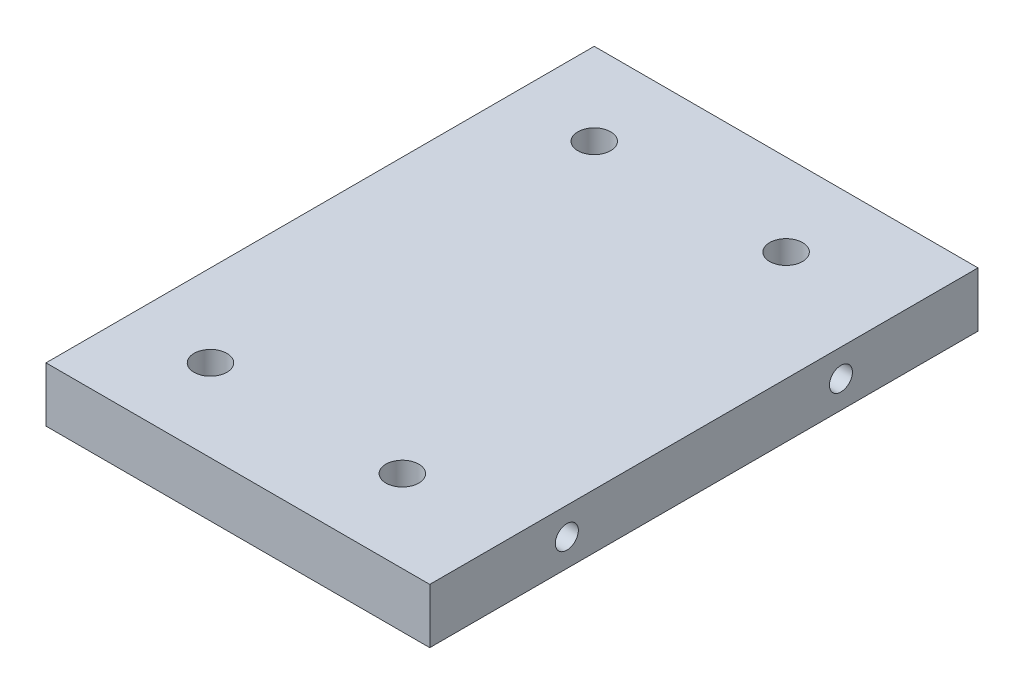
ISO-10303-21;
HEADER;
FILE_DESCRIPTION(('STEP AP214'),'2;1');
FILE_NAME('part.step','',(''),(''),'','','');
FILE_SCHEMA(('AUTOMOTIVE_DESIGN { 1 0 10303 214 1 1 1 1 }'));
ENDSEC;
DATA;
#1=APPLICATION_CONTEXT('core data for automotive mechanical design processes');
#2=APPLICATION_PROTOCOL_DEFINITION('international standard','automotive_design',2000,#1);
#3=PRODUCT_CONTEXT('',#1,'mechanical');
#4=PRODUCT('Part','Part','',(#3));
#5=PRODUCT_RELATED_PRODUCT_CATEGORY('part','',(#4));
#6=PRODUCT_DEFINITION_FORMATION('','',#4);
#7=PRODUCT_DEFINITION_CONTEXT('part definition',#1,'design');
#8=PRODUCT_DEFINITION('design','',#6,#7);
#9=PRODUCT_DEFINITION_SHAPE('','',#8);
#10=(LENGTH_UNIT() NAMED_UNIT(*) SI_UNIT(.MILLI.,.METRE.));
#11=(NAMED_UNIT(*) PLANE_ANGLE_UNIT() SI_UNIT($,.RADIAN.));
#12=(NAMED_UNIT(*) SI_UNIT($,.STERADIAN.) SOLID_ANGLE_UNIT());
#13=UNCERTAINTY_MEASURE_WITH_UNIT(LENGTH_MEASURE(1.E-05),#10,'distance_accuracy_value','');
#14=(GEOMETRIC_REPRESENTATION_CONTEXT(3) GLOBAL_UNCERTAINTY_ASSIGNED_CONTEXT((#13)) GLOBAL_UNIT_ASSIGNED_CONTEXT((#10,
#11,#12)) REPRESENTATION_CONTEXT('',''));
#15=CARTESIAN_POINT('',(0.,0.,0.));
#16=DIRECTION('',(0.,0.,1.));
#17=DIRECTION('',(1.,0.,0.));
#18=AXIS2_PLACEMENT_3D('',#15,#16,#17);
#19=CARTESIAN_POINT('',(70.,0.,100.));
#20=DIRECTION('',(-1.,0.,0.));
#21=DIRECTION('',(0.,0.,1.));
#22=AXIS2_PLACEMENT_3D('',#19,#20,#21);
#23=PLANE('',#22);
#24=CARTESIAN_POINT('',(70.,5.,75.));
#25=DIRECTION('',(1.,0.,0.));
#26=DIRECTION('',(0.,0.,-1.));
#27=AXIS2_PLACEMENT_3D('',#24,#25,#26);
#28=CIRCLE('',#27,2.1);
#29=CARTESIAN_POINT('',(70.,5.,72.9));
#30=VERTEX_POINT('',#29);
#31=EDGE_CURVE('E104',#30,#30,#28,.T.);
#32=ORIENTED_EDGE('',*,*,#31,.F.);
#33=EDGE_LOOP('',(#32));
#34=FACE_BOUND('',#33,.T.);
#35=DIRECTION('',(0.,1.,0.));
#36=VECTOR('',#35,1.);
#37=CARTESIAN_POINT('',(70.,0.,0.));
#38=LINE('',#37,#36);
#39=CARTESIAN_POINT('',(70.,0.,0.));
#40=VERTEX_POINT('',#39);
#41=CARTESIAN_POINT('',(70.,10.,0.));
#42=VERTEX_POINT('',#41);
#43=EDGE_CURVE('E73',#40,#42,#38,.T.);
#44=ORIENTED_EDGE('',*,*,#43,.T.);
#45=DIRECTION('',(0.,0.,-1.));
#46=VECTOR('',#45,1.);
#47=CARTESIAN_POINT('',(70.,10.,100.));
#48=LINE('',#47,#46);
#49=CARTESIAN_POINT('',(70.,10.,100.));
#50=VERTEX_POINT('',#49);
#51=EDGE_CURVE('E153',#50,#42,#48,.T.);
#52=ORIENTED_EDGE('',*,*,#51,.F.);
#53=DIRECTION('',(0.,1.,0.));
#54=VECTOR('',#53,1.);
#55=CARTESIAN_POINT('',(70.,0.,100.));
#56=LINE('',#55,#54);
#57=CARTESIAN_POINT('',(70.,0.,100.));
#58=VERTEX_POINT('',#57);
#59=EDGE_CURVE('E142',#58,#50,#56,.T.);
#60=ORIENTED_EDGE('',*,*,#59,.F.);
#61=DIRECTION('',(0.,0.,-1.));
#62=VECTOR('',#61,1.);
#63=CARTESIAN_POINT('',(70.,0.,100.));
#64=LINE('',#63,#62);
#65=EDGE_CURVE('E47',#58,#40,#64,.T.);
#66=ORIENTED_EDGE('',*,*,#65,.T.);
#67=EDGE_LOOP('',(#44,#52,#60,#66));
#68=FACE_BOUND('',#67,.T.);
#69=CARTESIAN_POINT('',(70.,5.,25.));
#70=DIRECTION('',(1.,0.,0.));
#71=DIRECTION('',(0.,0.,-1.));
#72=AXIS2_PLACEMENT_3D('',#69,#70,#71);
#73=CIRCLE('',#72,2.1);
#74=CARTESIAN_POINT('',(70.,5.,22.9));
#75=VERTEX_POINT('',#74);
#76=EDGE_CURVE('E103',#75,#75,#73,.T.);
#77=ORIENTED_EDGE('',*,*,#76,.F.);
#78=EDGE_LOOP('',(#77));
#79=FACE_BOUND('',#78,.T.);
#80=ADVANCED_FACE('F38',(#34,#68,#79),#23,.F.);
#81=CARTESIAN_POINT('',(0.,0.,100.));
#82=DIRECTION('',(1.,0.,0.));
#83=DIRECTION('',(0.,0.,-1.));
#84=AXIS2_PLACEMENT_3D('',#81,#82,#83);
#85=PLANE('',#84);
#86=DIRECTION('',(0.,-1.,0.));
#87=VECTOR('',#86,1.);
#88=CARTESIAN_POINT('',(0.,0.,0.));
#89=LINE('',#88,#87);
#90=CARTESIAN_POINT('',(0.,10.,0.));
#91=VERTEX_POINT('',#90);
#92=CARTESIAN_POINT('',(0.,0.,0.));
#93=VERTEX_POINT('',#92);
#94=EDGE_CURVE('E136',#91,#93,#89,.T.);
#95=ORIENTED_EDGE('',*,*,#94,.T.);
#96=DIRECTION('',(0.,0.,-1.));
#97=VECTOR('',#96,1.);
#98=CARTESIAN_POINT('',(0.,0.,100.));
#99=LINE('',#98,#97);
#100=CARTESIAN_POINT('',(0.,0.,100.));
#101=VERTEX_POINT('',#100);
#102=EDGE_CURVE('E11',#101,#93,#99,.T.);
#103=ORIENTED_EDGE('',*,*,#102,.F.);
#104=DIRECTION('',(0.,-1.,0.));
#105=VECTOR('',#104,1.);
#106=CARTESIAN_POINT('',(0.,0.,100.));
#107=LINE('',#106,#105);
#108=CARTESIAN_POINT('',(0.,10.,100.));
#109=VERTEX_POINT('',#108);
#110=EDGE_CURVE('E139',#109,#101,#107,.T.);
#111=ORIENTED_EDGE('',*,*,#110,.F.);
#112=DIRECTION('',(0.,0.,-1.));
#113=VECTOR('',#112,1.);
#114=CARTESIAN_POINT('',(0.,10.,100.));
#115=LINE('',#114,#113);
#116=EDGE_CURVE('E145',#109,#91,#115,.T.);
#117=ORIENTED_EDGE('',*,*,#116,.T.);
#118=EDGE_LOOP('',(#95,#103,#111,#117));
#119=FACE_BOUND('',#118,.T.);
#120=ADVANCED_FACE('F40',(#119),#85,.F.);
#121=CARTESIAN_POINT('',(0.,0.,100.));
#122=DIRECTION('',(0.,1.,0.));
#123=DIRECTION('',(0.,0.,1.));
#124=AXIS2_PLACEMENT_3D('',#121,#122,#123);
#125=PLANE('',#124);
#126=CARTESIAN_POINT('',(15.,0.,85.));
#127=DIRECTION('',(0.,1.,0.));
#128=DIRECTION('',(0.,0.,1.));
#129=AXIS2_PLACEMENT_3D('',#126,#127,#128);
#130=CIRCLE('',#129,3.);
#131=CARTESIAN_POINT('',(15.,0.,88.));
#132=VERTEX_POINT('',#131);
#133=EDGE_CURVE('E115',#132,#132,#130,.T.);
#134=ORIENTED_EDGE('',*,*,#133,.T.);
#135=EDGE_LOOP('',(#134));
#136=FACE_BOUND('',#135,.T.);
#137=CARTESIAN_POINT('',(50.,0.,85.));
#138=DIRECTION('',(0.,1.,0.));
#139=DIRECTION('',(0.,0.,1.));
#140=AXIS2_PLACEMENT_3D('',#137,#138,#139);
#141=CIRCLE('',#140,3.00000000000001);
#142=CARTESIAN_POINT('',(50.,0.,88.));
#143=VERTEX_POINT('',#142);
#144=EDGE_CURVE('E121',#143,#143,#141,.T.);
#145=ORIENTED_EDGE('',*,*,#144,.T.);
#146=EDGE_LOOP('',(#145));
#147=FACE_BOUND('',#146,.T.);
#148=CARTESIAN_POINT('',(50.,0.,15.));
#149=DIRECTION('',(0.,1.,0.));
#150=DIRECTION('',(0.,0.,1.));
#151=AXIS2_PLACEMENT_3D('',#148,#149,#150);
#152=CIRCLE('',#151,3.00000000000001);
#153=CARTESIAN_POINT('',(50.,0.,18.));
#154=VERTEX_POINT('',#153);
#155=EDGE_CURVE('E127',#154,#154,#152,.T.);
#156=ORIENTED_EDGE('',*,*,#155,.T.);
#157=EDGE_LOOP('',(#156));
#158=FACE_BOUND('',#157,.T.);
#159=CARTESIAN_POINT('',(15.,0.,15.));
#160=DIRECTION('',(0.,1.,0.));
#161=DIRECTION('',(0.,0.,1.));
#162=AXIS2_PLACEMENT_3D('',#159,#160,#161);
#163=CIRCLE('',#162,3.);
#164=CARTESIAN_POINT('',(15.,0.,18.));
#165=VERTEX_POINT('',#164);
#166=EDGE_CURVE('E133',#165,#165,#163,.T.);
#167=ORIENTED_EDGE('',*,*,#166,.T.);
#168=EDGE_LOOP('',(#167));
#169=FACE_BOUND('',#168,.T.);
#170=DIRECTION('',(1.,0.,0.));
#171=VECTOR('',#170,1.);
#172=CARTESIAN_POINT('',(0.,0.,0.));
#173=LINE('',#172,#171);
#174=EDGE_CURVE('E148',#93,#40,#173,.T.);
#175=ORIENTED_EDGE('',*,*,#174,.T.);
#176=ORIENTED_EDGE('',*,*,#65,.F.);
#177=DIRECTION('',(1.,0.,0.));
#178=VECTOR('',#177,1.);
#179=CARTESIAN_POINT('',(0.,0.,100.));
#180=LINE('',#179,#178);
#181=EDGE_CURVE('E86',#101,#58,#180,.T.);
#182=ORIENTED_EDGE('',*,*,#181,.F.);
#183=ORIENTED_EDGE('',*,*,#102,.T.);
#184=EDGE_LOOP('',(#175,#176,#182,#183));
#185=FACE_BOUND('',#184,.T.);
#186=ADVANCED_FACE('F165',(#136,#147,#158,#169,#185),#125,.F.);
#187=CARTESIAN_POINT('',(0.,10.,100.));
#188=DIRECTION('',(0.,-1.,0.));
#189=DIRECTION('',(0.,0.,-1.));
#190=AXIS2_PLACEMENT_3D('',#187,#188,#189);
#191=PLANE('',#190);
#192=CARTESIAN_POINT('',(15.,10.,85.));
#193=DIRECTION('',(0.,1.,0.));
#194=DIRECTION('',(0.,0.,1.));
#195=AXIS2_PLACEMENT_3D('',#192,#193,#194);
#196=CIRCLE('',#195,3.);
#197=CARTESIAN_POINT('',(15.,10.,88.));
#198=VERTEX_POINT('',#197);
#199=EDGE_CURVE('E114',#198,#198,#196,.T.);
#200=ORIENTED_EDGE('',*,*,#199,.F.);
#201=EDGE_LOOP('',(#200));
#202=FACE_BOUND('',#201,.T.);
#203=CARTESIAN_POINT('',(50.,10.,85.));
#204=DIRECTION('',(0.,1.,0.));
#205=DIRECTION('',(0.,0.,1.));
#206=AXIS2_PLACEMENT_3D('',#203,#204,#205);
#207=CIRCLE('',#206,3.00000000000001);
#208=CARTESIAN_POINT('',(50.,10.,88.));
#209=VERTEX_POINT('',#208);
#210=EDGE_CURVE('E118',#209,#209,#207,.T.);
#211=ORIENTED_EDGE('',*,*,#210,.F.);
#212=EDGE_LOOP('',(#211));
#213=FACE_BOUND('',#212,.T.);
#214=CARTESIAN_POINT('',(50.,10.,15.));
#215=DIRECTION('',(0.,1.,0.));
#216=DIRECTION('',(0.,0.,1.));
#217=AXIS2_PLACEMENT_3D('',#214,#215,#216);
#218=CIRCLE('',#217,3.00000000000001);
#219=CARTESIAN_POINT('',(50.,10.,18.));
#220=VERTEX_POINT('',#219);
#221=EDGE_CURVE('E124',#220,#220,#218,.T.);
#222=ORIENTED_EDGE('',*,*,#221,.F.);
#223=EDGE_LOOP('',(#222));
#224=FACE_BOUND('',#223,.T.);
#225=CARTESIAN_POINT('',(15.,10.,15.));
#226=DIRECTION('',(0.,1.,0.));
#227=DIRECTION('',(0.,0.,1.));
#228=AXIS2_PLACEMENT_3D('',#225,#226,#227);
#229=CIRCLE('',#228,3.);
#230=CARTESIAN_POINT('',(15.,10.,18.));
#231=VERTEX_POINT('',#230);
#232=EDGE_CURVE('E130',#231,#231,#229,.T.);
#233=ORIENTED_EDGE('',*,*,#232,.F.);
#234=EDGE_LOOP('',(#233));
#235=FACE_BOUND('',#234,.T.);
#236=DIRECTION('',(-1.,0.,0.));
#237=VECTOR('',#236,1.);
#238=CARTESIAN_POINT('',(0.,10.,0.));
#239=LINE('',#238,#237);
#240=EDGE_CURVE('E79',#42,#91,#239,.T.);
#241=ORIENTED_EDGE('',*,*,#240,.T.);
#242=ORIENTED_EDGE('',*,*,#116,.F.);
#243=DIRECTION('',(-1.,0.,0.));
#244=VECTOR('',#243,1.);
#245=CARTESIAN_POINT('',(0.,10.,100.));
#246=LINE('',#245,#244);
#247=EDGE_CURVE('E55',#50,#109,#246,.T.);
#248=ORIENTED_EDGE('',*,*,#247,.F.);
#249=ORIENTED_EDGE('',*,*,#51,.T.);
#250=EDGE_LOOP('',(#241,#242,#248,#249));
#251=FACE_BOUND('',#250,.T.);
#252=ADVANCED_FACE('F162',(#202,#213,#224,#235,#251),#191,.F.);
#253=CARTESIAN_POINT('',(0.,0.,100.));
#254=DIRECTION('',(0.,0.,-1.));
#255=DIRECTION('',(-1.,0.,0.));
#256=AXIS2_PLACEMENT_3D('',#253,#254,#255);
#257=PLANE('',#256);
#258=ORIENTED_EDGE('',*,*,#110,.T.);
#259=ORIENTED_EDGE('',*,*,#181,.T.);
#260=ORIENTED_EDGE('',*,*,#59,.T.);
#261=ORIENTED_EDGE('',*,*,#247,.T.);
#262=EDGE_LOOP('',(#258,#259,#260,#261));
#263=FACE_BOUND('',#262,.T.);
#264=ADVANCED_FACE('F164',(#263),#257,.F.);
#265=CARTESIAN_POINT('',(0.,0.,0.));
#266=DIRECTION('',(0.,0.,-1.));
#267=DIRECTION('',(-1.,0.,0.));
#268=AXIS2_PLACEMENT_3D('',#265,#266,#267);
#269=PLANE('',#268);
#270=ORIENTED_EDGE('',*,*,#94,.F.);
#271=ORIENTED_EDGE('',*,*,#240,.F.);
#272=ORIENTED_EDGE('',*,*,#43,.F.);
#273=ORIENTED_EDGE('',*,*,#174,.F.);
#274=EDGE_LOOP('',(#270,#271,#272,#273));
#275=FACE_BOUND('',#274,.T.);
#276=ADVANCED_FACE('F158',(#275),#269,.T.);
#277=CARTESIAN_POINT('',(15.,0.,15.));
#278=DIRECTION('',(0.,1.,0.));
#279=DIRECTION('',(0.,0.,1.));
#280=AXIS2_PLACEMENT_3D('',#277,#278,#279);
#281=CYLINDRICAL_SURFACE('',#280,3.);
#282=ORIENTED_EDGE('',*,*,#166,.F.);
#283=EDGE_LOOP('',(#282));
#284=FACE_BOUND('',#283,.T.);
#285=ORIENTED_EDGE('',*,*,#232,.T.);
#286=EDGE_LOOP('',(#285));
#287=FACE_BOUND('',#286,.T.);
#288=ADVANCED_FACE('F208',(#284,#287),#281,.F.);
#289=CARTESIAN_POINT('',(50.,0.,15.));
#290=DIRECTION('',(0.,1.,0.));
#291=DIRECTION('',(0.,0.,1.));
#292=AXIS2_PLACEMENT_3D('',#289,#290,#291);
#293=CYLINDRICAL_SURFACE('',#292,3.00000000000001);
#294=ORIENTED_EDGE('',*,*,#155,.F.);
#295=EDGE_LOOP('',(#294));
#296=FACE_BOUND('',#295,.T.);
#297=ORIENTED_EDGE('',*,*,#221,.T.);
#298=EDGE_LOOP('',(#297));
#299=FACE_BOUND('',#298,.T.);
#300=ADVANCED_FACE('F204',(#296,#299),#293,.F.);
#301=CARTESIAN_POINT('',(50.,0.,85.));
#302=DIRECTION('',(0.,1.,0.));
#303=DIRECTION('',(0.,0.,1.));
#304=AXIS2_PLACEMENT_3D('',#301,#302,#303);
#305=CYLINDRICAL_SURFACE('',#304,3.00000000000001);
#306=ORIENTED_EDGE('',*,*,#144,.F.);
#307=EDGE_LOOP('',(#306));
#308=FACE_BOUND('',#307,.T.);
#309=ORIENTED_EDGE('',*,*,#210,.T.);
#310=EDGE_LOOP('',(#309));
#311=FACE_BOUND('',#310,.T.);
#312=ADVANCED_FACE('F200',(#308,#311),#305,.F.);
#313=CARTESIAN_POINT('',(15.,0.,85.));
#314=DIRECTION('',(0.,1.,0.));
#315=DIRECTION('',(0.,0.,1.));
#316=AXIS2_PLACEMENT_3D('',#313,#314,#315);
#317=CYLINDRICAL_SURFACE('',#316,3.);
#318=ORIENTED_EDGE('',*,*,#133,.F.);
#319=EDGE_LOOP('',(#318));
#320=FACE_BOUND('',#319,.T.);
#321=ORIENTED_EDGE('',*,*,#199,.T.);
#322=EDGE_LOOP('',(#321));
#323=FACE_BOUND('',#322,.T.);
#324=ADVANCED_FACE('F196',(#320,#323),#317,.F.);
#325=CARTESIAN_POINT('',(55.,5.,25.));
#326=DIRECTION('',(1.,0.,0.));
#327=DIRECTION('',(0.,0.,-1.));
#328=AXIS2_PLACEMENT_3D('',#325,#326,#327);
#329=CONICAL_SURFACE('',#328,2.1,1.02974425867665);
#330=CARTESIAN_POINT('',(53.7381927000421,5.,25.));
#331=VERTEX_POINT('',#330);
#332=VERTEX_LOOP('',#331);
#333=FACE_BOUND('',#332,.T.);
#334=CARTESIAN_POINT('',(55.,5.,25.));
#335=DIRECTION('',(1.,0.,0.));
#336=DIRECTION('',(0.,0.,-1.));
#337=AXIS2_PLACEMENT_3D('',#334,#335,#336);
#338=CIRCLE('',#337,2.1);
#339=CARTESIAN_POINT('',(55.,5.,22.9));
#340=VERTEX_POINT('',#339);
#341=EDGE_CURVE('E107',#340,#340,#338,.T.);
#342=ORIENTED_EDGE('',*,*,#341,.T.);
#343=EDGE_LOOP('',(#342));
#344=FACE_BOUND('',#343,.T.);
#345=ADVANCED_FACE('F192',(#333,#344),#329,.F.);
#346=CARTESIAN_POINT('',(70.,5.,25.));
#347=DIRECTION('',(1.,0.,0.));
#348=DIRECTION('',(0.,0.,-1.));
#349=AXIS2_PLACEMENT_3D('',#346,#347,#348);
#350=CYLINDRICAL_SURFACE('',#349,2.1);
#351=ORIENTED_EDGE('',*,*,#341,.F.);
#352=EDGE_LOOP('',(#351));
#353=FACE_BOUND('',#352,.T.);
#354=ORIENTED_EDGE('',*,*,#76,.T.);
#355=EDGE_LOOP('',(#354));
#356=FACE_BOUND('',#355,.T.);
#357=ADVANCED_FACE('F97',(#353,#356),#350,.F.);
#358=CARTESIAN_POINT('',(55.,5.,75.));
#359=DIRECTION('',(1.,0.,0.));
#360=DIRECTION('',(0.,0.,-1.));
#361=AXIS2_PLACEMENT_3D('',#358,#359,#360);
#362=CONICAL_SURFACE('',#361,2.1,1.02974425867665);
#363=CARTESIAN_POINT('',(53.7381927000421,5.,75.));
#364=VERTEX_POINT('',#363);
#365=VERTEX_LOOP('',#364);
#366=FACE_BOUND('',#365,.T.);
#367=CARTESIAN_POINT('',(55.,5.,75.));
#368=DIRECTION('',(1.,0.,0.));
#369=DIRECTION('',(0.,0.,-1.));
#370=AXIS2_PLACEMENT_3D('',#367,#368,#369);
#371=CIRCLE('',#370,2.1);
#372=CARTESIAN_POINT('',(55.,5.,72.9));
#373=VERTEX_POINT('',#372);
#374=EDGE_CURVE('E101',#373,#373,#371,.T.);
#375=ORIENTED_EDGE('',*,*,#374,.T.);
#376=EDGE_LOOP('',(#375));
#377=FACE_BOUND('',#376,.T.);
#378=ADVANCED_FACE('F93',(#366,#377),#362,.F.);
#379=CARTESIAN_POINT('',(70.,5.,75.));
#380=DIRECTION('',(1.,0.,0.));
#381=DIRECTION('',(0.,0.,-1.));
#382=AXIS2_PLACEMENT_3D('',#379,#380,#381);
#383=CYLINDRICAL_SURFACE('',#382,2.1);
#384=ORIENTED_EDGE('',*,*,#374,.F.);
#385=EDGE_LOOP('',(#384));
#386=FACE_BOUND('',#385,.T.);
#387=ORIENTED_EDGE('',*,*,#31,.T.);
#388=EDGE_LOOP('',(#387));
#389=FACE_BOUND('',#388,.T.);
#390=ADVANCED_FACE('F96',(#386,#389),#383,.F.);
#391=CLOSED_SHELL('',(#80,#120,#186,#252,#264,#276,#288,#300,#312,#324,#345,#357,#378,#390));
#392=MANIFOLD_SOLID_BREP('B2',#391);
#393=ADVANCED_BREP_SHAPE_REPRESENTATION('',(#18,#392),#14);
#394=SHAPE_DEFINITION_REPRESENTATION(#9,#393);
ENDSEC;
END-ISO-10303-21;
